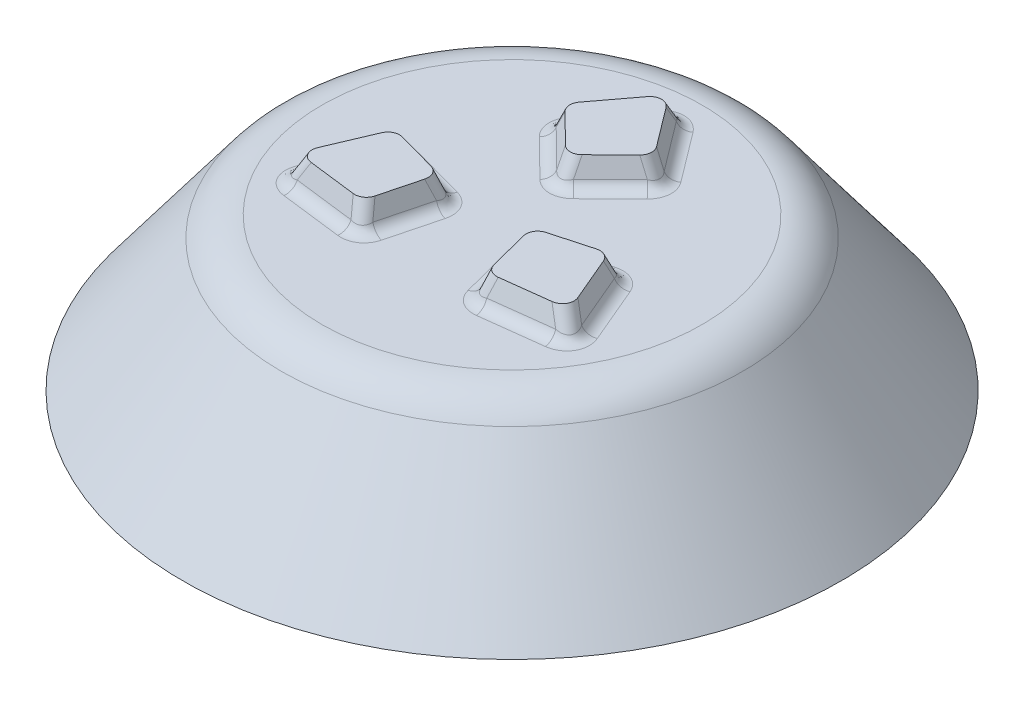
from build123d import *

# Parameters (mm, degrees)
BOSS_EXTRUDE1_DEPTH = 1
BOSS_EXTRUDE1_TAPER = 20
CIRPATTERN1_COUNT   = 3
FILLET1_R           = 2
FILLET2_R           = 0.5


with BuildPart() as part:
    # Sketch1 → Revolve1 (revolve)
    with BuildSketch(Plane(origin=(0, 0, 0), x_dir=(0, 0, -1), z_dir=(1, 0, 0))):
        Polygon((0, 4), (7.5, 4), (10.5, 0), (13, 0), (8.5, 6), (0, 6), align=None)
    revolve(axis=Axis((0, 0, 0), (0, 1, 0)))

    # Sketch2 → Boss-Extrude1 (add)
    with BuildSketch(Plane(origin=(0, 6, 0), x_dir=(1, 0, 0), z_dir=(0, 1, 0))):
        Polygon((0, 6.8), (-2.25, 3.816166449), (0, 1.6), (2.25, 3.816166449), align=None)
    boss_extrude1 = extrude(amount=BOSS_EXTRUDE1_DEPTH, taper=BOSS_EXTRUDE1_TAPER)

    # CirPattern1: Boss-Extrude1 ×3 about axis
    cirpattern1_axis = Axis((0, 0, 0), (0, 1, 0))
    for i in range(1, CIRPATTERN1_COUNT):
        add(boss_extrude1.rotate(cirpattern1_axis, i * 360 / CIRPATTERN1_COUNT))

    # Fillet1
    fillet1_edges = [part.edges().sort_by_distance(p)[0] for p in [
        (0, 6, 8.5),
    ]]
    fillet(fillet1_edges, radius=FILLET1_R)

    # Fillet2
    fillet2_edges = [part.edges().sort_by_distance(p)[0] for p in [
        (1.125, 6, -5.308083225),
        (2.008686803, 6.5, -3.833920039),
        (-1.125, 6, -5.308083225),
        (0, 6.5, -6.497736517),
        (-1.125, 6, -2.708083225),
        (-2.008686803, 6.5, -3.833920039),
        (1.125, 6, -2.708083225),
        (0, 6.5, -1.855438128),
        (4.034434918, 6, 3.628320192),
        (2.315928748, 6.5, 3.656533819),
        (5.159434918, 6, 1.679763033),
        (5.62720489, 6.5, 3.248868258),
        (2.907768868, 6, 0.379763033),
        (4.324615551, 6.5, 0.17738622),
        (1.782768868, 6, 2.328320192),
        (1.606856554, 6.5, 0.927719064),
        (-5.159434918, 6, 1.679763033),
        (-4.324615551, 6.5, 0.17738622),
        (-4.034434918, 6, 3.628320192),
        (-5.62720489, 6.5, 3.248868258),
        (-1.782768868, 6, 2.328320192),
        (-2.315928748, 6.5, 3.656533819),
        (-2.907768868, 6, 0.379763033),
        (-1.606856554, 6.5, 0.927719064),
    ]]
    fillet(fillet2_edges, radius=FILLET2_R)


solid = part.part
